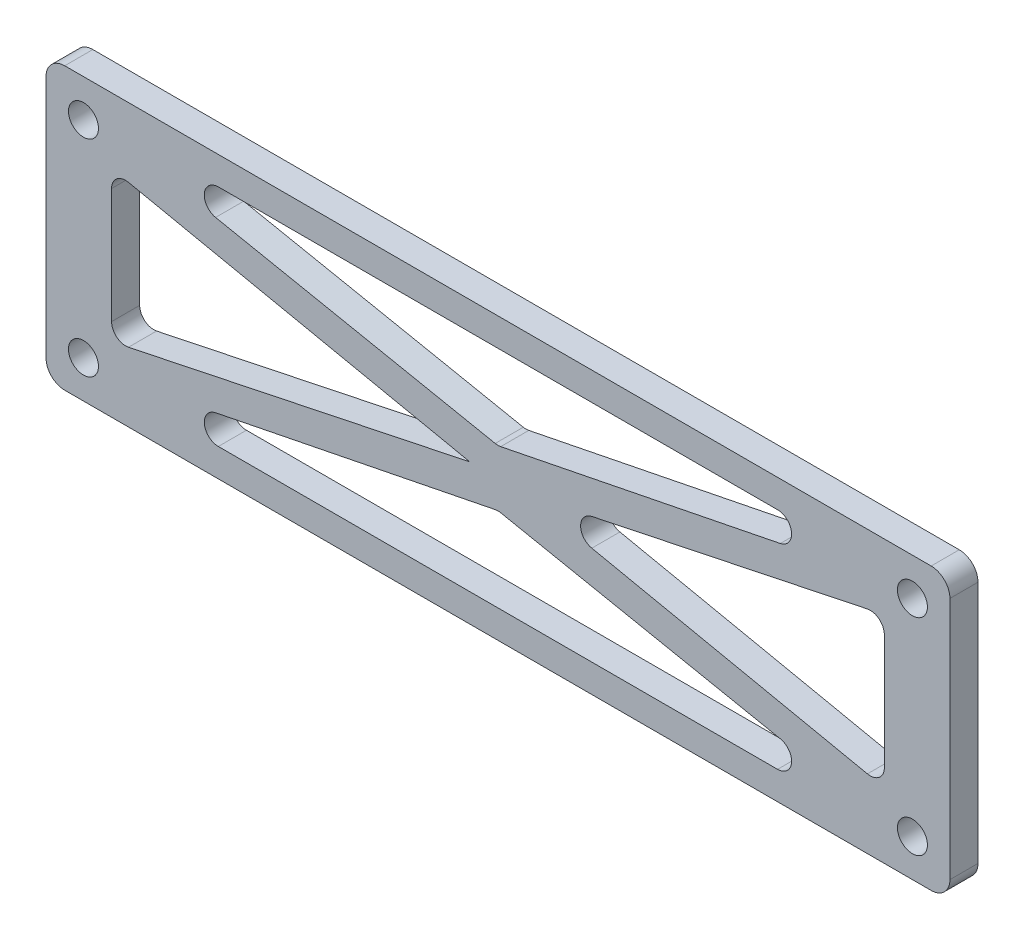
ISO-10303-21;
HEADER;
FILE_DESCRIPTION(('STEP AP214'),'2;1');
FILE_NAME('part.step','',(''),(''),'','','');
FILE_SCHEMA(('AUTOMOTIVE_DESIGN { 1 0 10303 214 1 1 1 1 }'));
ENDSEC;
DATA;
#1=APPLICATION_CONTEXT('core data for automotive mechanical design processes');
#2=APPLICATION_PROTOCOL_DEFINITION('international standard','automotive_design',2000,#1);
#3=PRODUCT_CONTEXT('',#1,'mechanical');
#4=PRODUCT('Part','Part','',(#3));
#5=PRODUCT_RELATED_PRODUCT_CATEGORY('part','',(#4));
#6=PRODUCT_DEFINITION_FORMATION('','',#4);
#7=PRODUCT_DEFINITION_CONTEXT('part definition',#1,'design');
#8=PRODUCT_DEFINITION('design','',#6,#7);
#9=PRODUCT_DEFINITION_SHAPE('','',#8);
#10=(LENGTH_UNIT() NAMED_UNIT(*) SI_UNIT(.MILLI.,.METRE.));
#11=(NAMED_UNIT(*) PLANE_ANGLE_UNIT() SI_UNIT($,.RADIAN.));
#12=(NAMED_UNIT(*) SI_UNIT($,.STERADIAN.) SOLID_ANGLE_UNIT());
#13=UNCERTAINTY_MEASURE_WITH_UNIT(LENGTH_MEASURE(1.E-05),#10,'distance_accuracy_value','');
#14=(GEOMETRIC_REPRESENTATION_CONTEXT(3) GLOBAL_UNCERTAINTY_ASSIGNED_CONTEXT((#13)) GLOBAL_UNIT_ASSIGNED_CONTEXT((#10,
#11,#12)) REPRESENTATION_CONTEXT('',''));
#15=CARTESIAN_POINT('',(0.,0.,0.));
#16=DIRECTION('',(0.,0.,1.));
#17=DIRECTION('',(1.,0.,0.));
#18=AXIS2_PLACEMENT_3D('',#15,#16,#17);
#19=CARTESIAN_POINT('',(0.,0.,3.));
#20=DIRECTION('',(0.,0.,-1.));
#21=DIRECTION('',(-1.,0.,0.));
#22=AXIS2_PLACEMENT_3D('',#19,#20,#21);
#23=PLANE('',#22);
#24=CARTESIAN_POINT('',(-39.7507771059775,6.15382544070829,3.));
#25=DIRECTION('',(0.,0.,1.));
#26=DIRECTION('',(1.,0.,0.));
#27=AXIS2_PLACEMENT_3D('',#24,#25,#26);
#28=CIRCLE('',#27,1.5);
#29=CARTESIAN_POINT('',(-41.2507771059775,6.15382544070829,3.));
#30=VERTEX_POINT('',#29);
#31=CARTESIAN_POINT('',(-39.4437021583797,7.62205736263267,3.));
#32=VERTEX_POINT('',#31);
#33=EDGE_CURVE('E538',#30,#32,#28,.F.);
#34=ORIENTED_EDGE('',*,*,#33,.T.);
#35=DIRECTION('',(-0.978821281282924,0.2047166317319,0.));
#36=VECTOR('',#35,1.);
#37=CARTESIAN_POINT('',(-3.,0.,3.));
#38=LINE('',#37,#36);
#39=CARTESIAN_POINT('',(-2.99999999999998,0.,3.));
#40=VERTEX_POINT('',#39);
#41=EDGE_CURVE('E867',#32,#40,#38,.F.);
#42=ORIENTED_EDGE('',*,*,#41,.T.);
#43=DIRECTION('',(0.978821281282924,0.2047166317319,0.));
#44=VECTOR('',#43,1.);
#45=CARTESIAN_POINT('',(-39.4437021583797,-7.62205736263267,3.));
#46=LINE('',#45,#44);
#47=CARTESIAN_POINT('',(-39.4437021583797,-7.62205736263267,3.));
#48=VERTEX_POINT('',#47);
#49=EDGE_CURVE('E863',#40,#48,#46,.F.);
#50=ORIENTED_EDGE('',*,*,#49,.T.);
#51=CARTESIAN_POINT('',(-39.7507771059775,-6.15382544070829,3.));
#52=DIRECTION('',(0.,0.,1.));
#53=DIRECTION('',(1.,0.,0.));
#54=AXIS2_PLACEMENT_3D('',#51,#52,#53);
#55=CIRCLE('',#54,1.5);
#56=CARTESIAN_POINT('',(-41.2507771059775,-6.15382544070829,3.));
#57=VERTEX_POINT('',#56);
#58=EDGE_CURVE('E858',#57,#48,#55,.T.);
#59=ORIENTED_EDGE('',*,*,#58,.F.);
#60=DIRECTION('',(0.,1.,0.));
#61=VECTOR('',#60,1.);
#62=CARTESIAN_POINT('',(-41.2507771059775,0.,3.));
#63=LINE('',#62,#61);
#64=EDGE_CURVE('E854',#57,#30,#63,.T.);
#65=ORIENTED_EDGE('',*,*,#64,.T.);
#66=EDGE_LOOP('',(#34,#42,#50,#59,#65));
#67=FACE_BOUND('',#66,.T.);
#68=DIRECTION('',(0.98058067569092,0.196116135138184,0.));
#69=VECTOR('',#68,1.);
#70=CARTESIAN_POINT('',(0.294174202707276,3.05883484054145,3.));
#71=LINE('',#70,#69);
#72=CARTESIAN_POINT('',(30.1456449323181,9.02912898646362,3.));
#73=VERTEX_POINT('',#72);
#74=CARTESIAN_POINT('',(0.294174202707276,3.05883484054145,3.));
#75=VERTEX_POINT('',#74);
#76=EDGE_CURVE('E672',#73,#75,#71,.F.);
#77=ORIENTED_EDGE('',*,*,#76,.T.);
#78=CARTESIAN_POINT('',(0.,4.52970585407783,3.));
#79=DIRECTION('',(0.,0.,1.));
#80=DIRECTION('',(1.,0.,0.));
#81=AXIS2_PLACEMENT_3D('',#78,#79,#80);
#82=CIRCLE('',#81,1.5);
#83=CARTESIAN_POINT('',(-0.294174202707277,3.05883484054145,3.));
#84=VERTEX_POINT('',#83);
#85=EDGE_CURVE('E744',#75,#84,#82,.F.);
#86=ORIENTED_EDGE('',*,*,#85,.T.);
#87=DIRECTION('',(0.98058067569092,-0.196116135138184,0.));
#88=VECTOR('',#87,1.);
#89=CARTESIAN_POINT('',(-30.1456449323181,9.02912898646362,3.));
#90=LINE('',#89,#88);
#91=CARTESIAN_POINT('',(-30.1456449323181,9.02912898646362,3.));
#92=VERTEX_POINT('',#91);
#93=EDGE_CURVE('E740',#84,#92,#90,.F.);
#94=ORIENTED_EDGE('',*,*,#93,.T.);
#95=CARTESIAN_POINT('',(-29.8514707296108,10.5,3.));
#96=DIRECTION('',(0.,0.,1.));
#97=DIRECTION('',(1.,0.,0.));
#98=AXIS2_PLACEMENT_3D('',#95,#96,#97);
#99=CIRCLE('',#98,1.5);
#100=CARTESIAN_POINT('',(-29.8514707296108,12.,3.));
#101=VERTEX_POINT('',#100);
#102=EDGE_CURVE('E736',#92,#101,#99,.F.);
#103=ORIENTED_EDGE('',*,*,#102,.T.);
#104=DIRECTION('',(-1.,0.,0.));
#105=VECTOR('',#104,1.);
#106=CARTESIAN_POINT('',(0.,12.,3.));
#107=LINE('',#106,#105);
#108=CARTESIAN_POINT('',(29.8514707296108,12.,3.));
#109=VERTEX_POINT('',#108);
#110=EDGE_CURVE('E732',#101,#109,#107,.F.);
#111=ORIENTED_EDGE('',*,*,#110,.T.);
#112=CARTESIAN_POINT('',(29.8514707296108,10.5,3.));
#113=DIRECTION('',(0.,0.,1.));
#114=DIRECTION('',(1.,0.,0.));
#115=AXIS2_PLACEMENT_3D('',#112,#113,#114);
#116=CIRCLE('',#115,1.5);
#117=EDGE_CURVE('E649',#73,#109,#116,.T.);
#118=ORIENTED_EDGE('',*,*,#117,.F.);
#119=EDGE_LOOP('',(#77,#86,#94,#103,#111,#118));
#120=FACE_BOUND('',#119,.T.);
#121=CARTESIAN_POINT('',(-44.2507771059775,11.,3.));
#122=DIRECTION('',(0.,0.,-1.));
#123=DIRECTION('',(-1.,0.,0.));
#124=AXIS2_PLACEMENT_3D('',#121,#122,#123);
#125=CIRCLE('',#124,1.6);
#126=CARTESIAN_POINT('',(-45.8507771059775,11.,3.));
#127=VERTEX_POINT('',#126);
#128=EDGE_CURVE('E667',#127,#127,#125,.T.);
#129=ORIENTED_EDGE('',*,*,#128,.T.);
#130=EDGE_LOOP('',(#129));
#131=FACE_BOUND('',#130,.T.);
#132=CARTESIAN_POINT('',(-44.2507771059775,-11.,3.));
#133=DIRECTION('',(0.,0.,1.));
#134=DIRECTION('',(-1.,0.,0.));
#135=AXIS2_PLACEMENT_3D('',#132,#133,#134);
#136=CIRCLE('',#135,1.6);
#137=CARTESIAN_POINT('',(-45.8507771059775,-11.,3.));
#138=VERTEX_POINT('',#137);
#139=EDGE_CURVE('E666',#138,#138,#136,.T.);
#140=ORIENTED_EDGE('',*,*,#139,.F.);
#141=EDGE_LOOP('',(#140));
#142=FACE_BOUND('',#141,.T.);
#143=CARTESIAN_POINT('',(44.2507771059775,-11.,3.));
#144=DIRECTION('',(0.,0.,-1.));
#145=DIRECTION('',(1.,0.,0.));
#146=AXIS2_PLACEMENT_3D('',#143,#144,#145);
#147=CIRCLE('',#146,1.6);
#148=CARTESIAN_POINT('',(45.8507771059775,-11.,3.));
#149=VERTEX_POINT('',#148);
#150=EDGE_CURVE('E690',#149,#149,#147,.T.);
#151=ORIENTED_EDGE('',*,*,#150,.T.);
#152=EDGE_LOOP('',(#151));
#153=FACE_BOUND('',#152,.T.);
#154=CARTESIAN_POINT('',(44.2507771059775,11.,3.));
#155=DIRECTION('',(0.,0.,1.));
#156=DIRECTION('',(1.,0.,0.));
#157=AXIS2_PLACEMENT_3D('',#154,#155,#156);
#158=CIRCLE('',#157,1.6);
#159=CARTESIAN_POINT('',(45.8507771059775,11.,3.));
#160=VERTEX_POINT('',#159);
#161=EDGE_CURVE('E689',#160,#160,#158,.T.);
#162=ORIENTED_EDGE('',*,*,#161,.F.);
#163=EDGE_LOOP('',(#162));
#164=FACE_BOUND('',#163,.T.);
#165=DIRECTION('',(1.,0.,0.));
#166=VECTOR('',#165,1.);
#167=CARTESIAN_POINT('',(-48.2507771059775,-15.,3.));
#168=LINE('',#167,#166);
#169=CARTESIAN_POINT('',(-46.2507771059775,-15.,3.));
#170=VERTEX_POINT('',#169);
#171=CARTESIAN_POINT('',(46.2507771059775,-15.,3.));
#172=VERTEX_POINT('',#171);
#173=EDGE_CURVE('E711',#170,#172,#168,.T.);
#174=ORIENTED_EDGE('',*,*,#173,.T.);
#175=CARTESIAN_POINT('',(46.2507771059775,-13.,3.));
#176=DIRECTION('',(0.,0.,-1.));
#177=DIRECTION('',(-1.,0.,0.));
#178=AXIS2_PLACEMENT_3D('',#175,#176,#177);
#179=CIRCLE('',#178,2.);
#180=CARTESIAN_POINT('',(48.2507771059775,-13.,3.));
#181=VERTEX_POINT('',#180);
#182=EDGE_CURVE('E799',#172,#181,#179,.F.);
#183=ORIENTED_EDGE('',*,*,#182,.T.);
#184=DIRECTION('',(0.,1.,0.));
#185=VECTOR('',#184,1.);
#186=CARTESIAN_POINT('',(48.2507771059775,-15.,3.));
#187=LINE('',#186,#185);
#188=CARTESIAN_POINT('',(48.2507771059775,13.,3.));
#189=VERTEX_POINT('',#188);
#190=EDGE_CURVE('E717',#181,#189,#187,.T.);
#191=ORIENTED_EDGE('',*,*,#190,.T.);
#192=CARTESIAN_POINT('',(46.2507771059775,13.,3.));
#193=DIRECTION('',(0.,0.,-1.));
#194=DIRECTION('',(-1.,0.,0.));
#195=AXIS2_PLACEMENT_3D('',#192,#193,#194);
#196=CIRCLE('',#195,2.);
#197=CARTESIAN_POINT('',(46.2507771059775,15.,3.));
#198=VERTEX_POINT('',#197);
#199=EDGE_CURVE('E330',#189,#198,#196,.F.);
#200=ORIENTED_EDGE('',*,*,#199,.T.);
#201=DIRECTION('',(1.,0.,0.));
#202=VECTOR('',#201,1.);
#203=CARTESIAN_POINT('',(-48.2507771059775,15.,3.));
#204=LINE('',#203,#202);
#205=CARTESIAN_POINT('',(-46.2507771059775,15.,3.));
#206=VERTEX_POINT('',#205);
#207=EDGE_CURVE('E818',#206,#198,#204,.T.);
#208=ORIENTED_EDGE('',*,*,#207,.F.);
#209=CARTESIAN_POINT('',(-46.2507771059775,13.,3.));
#210=DIRECTION('',(0.,0.,-1.));
#211=DIRECTION('',(-1.,0.,0.));
#212=AXIS2_PLACEMENT_3D('',#209,#210,#211);
#213=CIRCLE('',#212,2.);
#214=CARTESIAN_POINT('',(-48.2507771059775,13.,3.));
#215=VERTEX_POINT('',#214);
#216=EDGE_CURVE('E794',#206,#215,#213,.F.);
#217=ORIENTED_EDGE('',*,*,#216,.T.);
#218=DIRECTION('',(0.,1.,0.));
#219=VECTOR('',#218,1.);
#220=CARTESIAN_POINT('',(-48.2507771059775,-15.,3.));
#221=LINE('',#220,#219);
#222=CARTESIAN_POINT('',(-48.2507771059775,-13.,3.));
#223=VERTEX_POINT('',#222);
#224=EDGE_CURVE('E703',#223,#215,#221,.T.);
#225=ORIENTED_EDGE('',*,*,#224,.F.);
#226=CARTESIAN_POINT('',(-46.2507771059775,-13.,3.));
#227=DIRECTION('',(0.,0.,-1.));
#228=DIRECTION('',(-1.,0.,0.));
#229=AXIS2_PLACEMENT_3D('',#226,#227,#228);
#230=CIRCLE('',#229,2.);
#231=EDGE_CURVE('E791',#223,#170,#230,.F.);
#232=ORIENTED_EDGE('',*,*,#231,.T.);
#233=EDGE_LOOP('',(#174,#183,#191,#200,#208,#217,#225,#232));
#234=FACE_BOUND('',#233,.T.);
#235=CARTESIAN_POINT('',(39.7507771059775,6.15382544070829,3.));
#236=DIRECTION('',(0.,0.,1.));
#237=DIRECTION('',(1.,0.,0.));
#238=AXIS2_PLACEMENT_3D('',#235,#236,#237);
#239=CIRCLE('',#238,1.5);
#240=CARTESIAN_POINT('',(39.4437021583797,7.62205736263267,3.));
#241=VERTEX_POINT('',#240);
#242=CARTESIAN_POINT('',(41.2507771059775,6.15382544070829,3.));
#243=VERTEX_POINT('',#242);
#244=EDGE_CURVE('E848',#241,#243,#239,.F.);
#245=ORIENTED_EDGE('',*,*,#244,.T.);
#246=DIRECTION('',(0.,1.,0.));
#247=VECTOR('',#246,1.);
#248=CARTESIAN_POINT('',(41.2507771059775,0.,3.));
#249=LINE('',#248,#247);
#250=CARTESIAN_POINT('',(41.2507771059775,-6.15382544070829,3.));
#251=VERTEX_POINT('',#250);
#252=EDGE_CURVE('E844',#251,#243,#249,.T.);
#253=ORIENTED_EDGE('',*,*,#252,.F.);
#254=CARTESIAN_POINT('',(39.7507771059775,-6.15382544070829,3.));
#255=DIRECTION('',(0.,0.,1.));
#256=DIRECTION('',(1.,0.,0.));
#257=AXIS2_PLACEMENT_3D('',#254,#255,#256);
#258=CIRCLE('',#257,1.5);
#259=CARTESIAN_POINT('',(39.4437021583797,-7.62205736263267,3.));
#260=VERTEX_POINT('',#259);
#261=EDGE_CURVE('E849',#260,#251,#258,.T.);
#262=ORIENTED_EDGE('',*,*,#261,.F.);
#263=DIRECTION('',(0.978821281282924,-0.2047166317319,0.));
#264=VECTOR('',#263,1.);
#265=CARTESIAN_POINT('',(0.125726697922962,0.601142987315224,3.));
#266=LINE('',#265,#264);
#267=CARTESIAN_POINT('',(10.0201264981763,-1.46823192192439,3.));
#268=VERTEX_POINT('',#267);
#269=EDGE_CURVE('E1283',#268,#260,#266,.T.);
#270=ORIENTED_EDGE('',*,*,#269,.F.);
#271=CARTESIAN_POINT('',(10.3272014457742,0.,3.));
#272=DIRECTION('',(0.,0.,1.));
#273=DIRECTION('',(1.,0.,0.));
#274=AXIS2_PLACEMENT_3D('',#271,#272,#273);
#275=CIRCLE('',#274,1.5);
#276=CARTESIAN_POINT('',(10.0201264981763,1.46823192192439,3.));
#277=VERTEX_POINT('',#276);
#278=EDGE_CURVE('E754',#277,#268,#275,.T.);
#279=ORIENTED_EDGE('',*,*,#278,.F.);
#280=DIRECTION('',(-0.978821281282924,-0.2047166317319,0.));
#281=VECTOR('',#280,1.);
#282=CARTESIAN_POINT('',(0.125726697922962,-0.601142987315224,3.));
#283=LINE('',#282,#281);
#284=EDGE_CURVE('E620',#241,#277,#283,.T.);
#285=ORIENTED_EDGE('',*,*,#284,.F.);
#286=EDGE_LOOP('',(#245,#253,#262,#270,#279,#285));
#287=FACE_BOUND('',#286,.T.);
#288=CARTESIAN_POINT('',(29.8514707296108,-10.5,3.));
#289=DIRECTION('',(0.,0.,1.));
#290=DIRECTION('',(1.,0.,0.));
#291=AXIS2_PLACEMENT_3D('',#288,#289,#290);
#292=CIRCLE('',#291,1.5);
#293=CARTESIAN_POINT('',(30.1456449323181,-9.02912898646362,3.));
#294=VERTEX_POINT('',#293);
#295=CARTESIAN_POINT('',(29.8514707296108,-12.,3.));
#296=VERTEX_POINT('',#295);
#297=EDGE_CURVE('E633',#294,#296,#292,.F.);
#298=ORIENTED_EDGE('',*,*,#297,.T.);
#299=DIRECTION('',(1.,0.,0.));
#300=VECTOR('',#299,1.);
#301=CARTESIAN_POINT('',(0.,-12.,3.));
#302=LINE('',#301,#300);
#303=CARTESIAN_POINT('',(-29.8514707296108,-12.,3.));
#304=VERTEX_POINT('',#303);
#305=EDGE_CURVE('E764',#304,#296,#302,.T.);
#306=ORIENTED_EDGE('',*,*,#305,.F.);
#307=CARTESIAN_POINT('',(-29.8514707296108,-10.5,3.));
#308=DIRECTION('',(0.,0.,1.));
#309=DIRECTION('',(1.,0.,0.));
#310=AXIS2_PLACEMENT_3D('',#307,#308,#309);
#311=CIRCLE('',#310,1.5);
#312=CARTESIAN_POINT('',(-30.1456449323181,-9.02912898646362,3.));
#313=VERTEX_POINT('',#312);
#314=EDGE_CURVE('E768',#313,#304,#311,.T.);
#315=ORIENTED_EDGE('',*,*,#314,.F.);
#316=DIRECTION('',(-0.98058067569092,-0.196116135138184,0.));
#317=VECTOR('',#316,1.);
#318=CARTESIAN_POINT('',(0.576923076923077,-2.88461538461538,3.));
#319=LINE('',#318,#317);
#320=CARTESIAN_POINT('',(-0.294174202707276,-3.05883484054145,3.));
#321=VERTEX_POINT('',#320);
#322=EDGE_CURVE('E879',#321,#313,#319,.T.);
#323=ORIENTED_EDGE('',*,*,#322,.F.);
#324=CARTESIAN_POINT('',(0.,-4.52970585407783,3.));
#325=DIRECTION('',(0.,0.,1.));
#326=DIRECTION('',(1.,0.,0.));
#327=AXIS2_PLACEMENT_3D('',#324,#325,#326);
#328=CIRCLE('',#327,1.5);
#329=CARTESIAN_POINT('',(0.294174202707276,-3.05883484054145,3.));
#330=VERTEX_POINT('',#329);
#331=EDGE_CURVE('E876',#321,#330,#328,.F.);
#332=ORIENTED_EDGE('',*,*,#331,.T.);
#333=DIRECTION('',(-0.98058067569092,0.196116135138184,0.));
#334=VECTOR('',#333,1.);
#335=CARTESIAN_POINT('',(-0.576923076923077,-2.88461538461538,3.));
#336=LINE('',#335,#334);
#337=EDGE_CURVE('E872',#294,#330,#336,.T.);
#338=ORIENTED_EDGE('',*,*,#337,.F.);
#339=EDGE_LOOP('',(#298,#306,#315,#323,#332,#338));
#340=FACE_BOUND('',#339,.T.);
#341=ADVANCED_FACE('F315',(#67,#120,#131,#142,#153,#164,#234,#287,#340),#23,.F.);
#342=CARTESIAN_POINT('',(0.,0.,0.));
#343=DIRECTION('',(0.,0.,-1.));
#344=DIRECTION('',(-1.,0.,0.));
#345=AXIS2_PLACEMENT_3D('',#342,#343,#344);
#346=PLANE('',#345);
#347=CARTESIAN_POINT('',(-44.2507771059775,11.,0.));
#348=DIRECTION('',(0.,0.,-1.));
#349=DIRECTION('',(-1.,0.,0.));
#350=AXIS2_PLACEMENT_3D('',#347,#348,#349);
#351=CIRCLE('',#350,1.6);
#352=CARTESIAN_POINT('',(-45.8507771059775,11.,0.));
#353=VERTEX_POINT('',#352);
#354=EDGE_CURVE('E663',#353,#353,#351,.T.);
#355=ORIENTED_EDGE('',*,*,#354,.F.);
#356=EDGE_LOOP('',(#355));
#357=FACE_BOUND('',#356,.T.);
#358=CARTESIAN_POINT('',(-44.2507771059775,-11.,0.));
#359=DIRECTION('',(0.,0.,1.));
#360=DIRECTION('',(-1.,0.,0.));
#361=AXIS2_PLACEMENT_3D('',#358,#359,#360);
#362=CIRCLE('',#361,1.6);
#363=CARTESIAN_POINT('',(-45.8507771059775,-11.,0.));
#364=VERTEX_POINT('',#363);
#365=EDGE_CURVE('E673',#364,#364,#362,.T.);
#366=ORIENTED_EDGE('',*,*,#365,.T.);
#367=EDGE_LOOP('',(#366));
#368=FACE_BOUND('',#367,.T.);
#369=CARTESIAN_POINT('',(44.2507771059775,-11.,0.));
#370=DIRECTION('',(0.,0.,-1.));
#371=DIRECTION('',(1.,0.,0.));
#372=AXIS2_PLACEMENT_3D('',#369,#370,#371);
#373=CIRCLE('',#372,1.6);
#374=CARTESIAN_POINT('',(45.8507771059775,-11.,0.));
#375=VERTEX_POINT('',#374);
#376=EDGE_CURVE('E687',#375,#375,#373,.T.);
#377=ORIENTED_EDGE('',*,*,#376,.F.);
#378=EDGE_LOOP('',(#377));
#379=FACE_BOUND('',#378,.T.);
#380=CARTESIAN_POINT('',(44.2507771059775,11.,0.));
#381=DIRECTION('',(0.,0.,1.));
#382=DIRECTION('',(1.,0.,0.));
#383=AXIS2_PLACEMENT_3D('',#380,#381,#382);
#384=CIRCLE('',#383,1.6);
#385=CARTESIAN_POINT('',(45.8507771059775,11.,0.));
#386=VERTEX_POINT('',#385);
#387=EDGE_CURVE('E695',#386,#386,#384,.T.);
#388=ORIENTED_EDGE('',*,*,#387,.T.);
#389=EDGE_LOOP('',(#388));
#390=FACE_BOUND('',#389,.T.);
#391=DIRECTION('',(0.,1.,0.));
#392=VECTOR('',#391,1.);
#393=CARTESIAN_POINT('',(48.2507771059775,-15.,0.));
#394=LINE('',#393,#392);
#395=CARTESIAN_POINT('',(48.2507771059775,-13.,0.));
#396=VERTEX_POINT('',#395);
#397=CARTESIAN_POINT('',(48.2507771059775,13.,0.));
#398=VERTEX_POINT('',#397);
#399=EDGE_CURVE('E724',#396,#398,#394,.T.);
#400=ORIENTED_EDGE('',*,*,#399,.F.);
#401=CARTESIAN_POINT('',(46.2507771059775,-13.,0.));
#402=DIRECTION('',(0.,0.,-1.));
#403=DIRECTION('',(-1.,0.,0.));
#404=AXIS2_PLACEMENT_3D('',#401,#402,#403);
#405=CIRCLE('',#404,2.);
#406=CARTESIAN_POINT('',(46.2507771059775,-15.,0.));
#407=VERTEX_POINT('',#406);
#408=EDGE_CURVE('E784',#396,#407,#405,.T.);
#409=ORIENTED_EDGE('',*,*,#408,.T.);
#410=DIRECTION('',(1.,0.,0.));
#411=VECTOR('',#410,1.);
#412=CARTESIAN_POINT('',(-48.2507771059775,-15.,0.));
#413=LINE('',#412,#411);
#414=CARTESIAN_POINT('',(-46.2507771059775,-15.,0.));
#415=VERTEX_POINT('',#414);
#416=EDGE_CURVE('E727',#415,#407,#413,.T.);
#417=ORIENTED_EDGE('',*,*,#416,.F.);
#418=CARTESIAN_POINT('',(-46.2507771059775,-13.,0.));
#419=DIRECTION('',(0.,0.,-1.));
#420=DIRECTION('',(-1.,0.,0.));
#421=AXIS2_PLACEMENT_3D('',#418,#419,#420);
#422=CIRCLE('',#421,2.);
#423=CARTESIAN_POINT('',(-48.2507771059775,-13.,0.));
#424=VERTEX_POINT('',#423);
#425=EDGE_CURVE('E778',#415,#424,#422,.T.);
#426=ORIENTED_EDGE('',*,*,#425,.T.);
#427=DIRECTION('',(0.,1.,0.));
#428=VECTOR('',#427,1.);
#429=CARTESIAN_POINT('',(-48.2507771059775,-15.,0.));
#430=LINE('',#429,#428);
#431=CARTESIAN_POINT('',(-48.2507771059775,13.,0.));
#432=VERTEX_POINT('',#431);
#433=EDGE_CURVE('E698',#424,#432,#430,.T.);
#434=ORIENTED_EDGE('',*,*,#433,.T.);
#435=CARTESIAN_POINT('',(-46.2507771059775,13.,0.));
#436=DIRECTION('',(0.,0.,-1.));
#437=DIRECTION('',(-1.,0.,0.));
#438=AXIS2_PLACEMENT_3D('',#435,#436,#437);
#439=CIRCLE('',#438,2.);
#440=CARTESIAN_POINT('',(-46.2507771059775,15.,0.));
#441=VERTEX_POINT('',#440);
#442=EDGE_CURVE('E780',#432,#441,#439,.T.);
#443=ORIENTED_EDGE('',*,*,#442,.T.);
#444=DIRECTION('',(1.,0.,0.));
#445=VECTOR('',#444,1.);
#446=CARTESIAN_POINT('',(-48.2507771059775,15.,0.));
#447=LINE('',#446,#445);
#448=CARTESIAN_POINT('',(46.2507771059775,15.,0.));
#449=VERTEX_POINT('',#448);
#450=EDGE_CURVE('E721',#441,#449,#447,.T.);
#451=ORIENTED_EDGE('',*,*,#450,.T.);
#452=CARTESIAN_POINT('',(46.2507771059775,13.,0.));
#453=DIRECTION('',(0.,0.,-1.));
#454=DIRECTION('',(-1.,0.,0.));
#455=AXIS2_PLACEMENT_3D('',#452,#453,#454);
#456=CIRCLE('',#455,2.);
#457=EDGE_CURVE('E782',#449,#398,#456,.T.);
#458=ORIENTED_EDGE('',*,*,#457,.T.);
#459=EDGE_LOOP('',(#400,#409,#417,#426,#434,#443,#451,#458));
#460=FACE_BOUND('',#459,.T.);
#461=CARTESIAN_POINT('',(0.,4.52970585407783,0.));
#462=DIRECTION('',(0.,0.,1.));
#463=DIRECTION('',(1.,0.,0.));
#464=AXIS2_PLACEMENT_3D('',#461,#462,#463);
#465=CIRCLE('',#464,1.5);
#466=CARTESIAN_POINT('',(0.294174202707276,3.05883484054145,0.));
#467=VERTEX_POINT('',#466);
#468=CARTESIAN_POINT('',(-0.294174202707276,3.05883484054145,0.));
#469=VERTEX_POINT('',#468);
#470=EDGE_CURVE('E643',#467,#469,#465,.F.);
#471=ORIENTED_EDGE('',*,*,#470,.F.);
#472=DIRECTION('',(-0.98058067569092,-0.196116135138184,0.));
#473=VECTOR('',#472,1.);
#474=CARTESIAN_POINT('',(-0.576923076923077,2.88461538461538,0.));
#475=LINE('',#474,#473);
#476=CARTESIAN_POINT('',(30.1456449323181,9.02912898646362,0.));
#477=VERTEX_POINT('',#476);
#478=EDGE_CURVE('E630',#477,#467,#475,.T.);
#479=ORIENTED_EDGE('',*,*,#478,.F.);
#480=CARTESIAN_POINT('',(29.8514707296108,10.5,0.));
#481=DIRECTION('',(0.,0.,1.));
#482=DIRECTION('',(1.,0.,0.));
#483=AXIS2_PLACEMENT_3D('',#480,#481,#482);
#484=CIRCLE('',#483,1.5);
#485=CARTESIAN_POINT('',(29.8514707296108,12.,0.));
#486=VERTEX_POINT('',#485);
#487=EDGE_CURVE('E632',#477,#486,#484,.T.);
#488=ORIENTED_EDGE('',*,*,#487,.T.);
#489=DIRECTION('',(1.,0.,0.));
#490=VECTOR('',#489,1.);
#491=CARTESIAN_POINT('',(0.,12.,0.));
#492=LINE('',#491,#490);
#493=CARTESIAN_POINT('',(-29.8514707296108,12.,0.));
#494=VERTEX_POINT('',#493);
#495=EDGE_CURVE('E636',#494,#486,#492,.T.);
#496=ORIENTED_EDGE('',*,*,#495,.F.);
#497=CARTESIAN_POINT('',(-29.8514707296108,10.5,0.));
#498=DIRECTION('',(0.,0.,1.));
#499=DIRECTION('',(1.,0.,0.));
#500=AXIS2_PLACEMENT_3D('',#497,#498,#499);
#501=CIRCLE('',#500,1.5);
#502=CARTESIAN_POINT('',(-30.1456449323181,9.02912898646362,0.));
#503=VERTEX_POINT('',#502);
#504=EDGE_CURVE('E639',#503,#494,#501,.F.);
#505=ORIENTED_EDGE('',*,*,#504,.F.);
#506=DIRECTION('',(-0.98058067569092,0.196116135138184,0.));
#507=VECTOR('',#506,1.);
#508=CARTESIAN_POINT('',(0.576923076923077,2.88461538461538,0.));
#509=LINE('',#508,#507);
#510=EDGE_CURVE('E641',#469,#503,#509,.T.);
#511=ORIENTED_EDGE('',*,*,#510,.F.);
#512=EDGE_LOOP('',(#471,#479,#488,#496,#505,#511));
#513=FACE_BOUND('',#512,.T.);
#514=DIRECTION('',(0.,1.,0.));
#515=VECTOR('',#514,1.);
#516=CARTESIAN_POINT('',(41.2507771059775,0.,0.));
#517=LINE('',#516,#515);
#518=CARTESIAN_POINT('',(41.2507771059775,-6.15382544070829,0.));
#519=VERTEX_POINT('',#518);
#520=CARTESIAN_POINT('',(41.2507771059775,6.15382544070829,0.));
#521=VERTEX_POINT('',#520);
#522=EDGE_CURVE('E609',#519,#521,#517,.T.);
#523=ORIENTED_EDGE('',*,*,#522,.T.);
#524=CARTESIAN_POINT('',(39.7507771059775,6.15382544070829,0.));
#525=DIRECTION('',(0.,0.,1.));
#526=DIRECTION('',(1.,0.,0.));
#527=AXIS2_PLACEMENT_3D('',#524,#525,#526);
#528=CIRCLE('',#527,1.5);
#529=CARTESIAN_POINT('',(39.4437021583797,7.62205736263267,0.));
#530=VERTEX_POINT('',#529);
#531=EDGE_CURVE('E586',#530,#521,#528,.F.);
#532=ORIENTED_EDGE('',*,*,#531,.F.);
#533=DIRECTION('',(-0.978821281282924,-0.2047166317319,0.));
#534=VECTOR('',#533,1.);
#535=CARTESIAN_POINT('',(0.125726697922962,-0.601142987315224,0.));
#536=LINE('',#535,#534);
#537=CARTESIAN_POINT('',(10.0201264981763,1.46823192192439,0.));
#538=VERTEX_POINT('',#537);
#539=EDGE_CURVE('E597',#530,#538,#536,.T.);
#540=ORIENTED_EDGE('',*,*,#539,.T.);
#541=CARTESIAN_POINT('',(10.3272014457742,0.,0.));
#542=DIRECTION('',(0.,0.,1.));
#543=DIRECTION('',(1.,0.,0.));
#544=AXIS2_PLACEMENT_3D('',#541,#542,#543);
#545=CIRCLE('',#544,1.5);
#546=CARTESIAN_POINT('',(10.0201264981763,-1.46823192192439,0.));
#547=VERTEX_POINT('',#546);
#548=EDGE_CURVE('E600',#538,#547,#545,.T.);
#549=ORIENTED_EDGE('',*,*,#548,.T.);
#550=DIRECTION('',(0.978821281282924,-0.2047166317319,0.));
#551=VECTOR('',#550,1.);
#552=CARTESIAN_POINT('',(0.125726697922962,0.601142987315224,0.));
#553=LINE('',#552,#551);
#554=CARTESIAN_POINT('',(39.4437021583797,-7.62205736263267,0.));
#555=VERTEX_POINT('',#554);
#556=EDGE_CURVE('E603',#547,#555,#553,.T.);
#557=ORIENTED_EDGE('',*,*,#556,.T.);
#558=CARTESIAN_POINT('',(39.7507771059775,-6.15382544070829,0.));
#559=DIRECTION('',(0.,0.,1.));
#560=DIRECTION('',(1.,0.,0.));
#561=AXIS2_PLACEMENT_3D('',#558,#559,#560);
#562=CIRCLE('',#561,1.5);
#563=EDGE_CURVE('E606',#555,#519,#562,.T.);
#564=ORIENTED_EDGE('',*,*,#563,.T.);
#565=EDGE_LOOP('',(#523,#532,#540,#549,#557,#564));
#566=FACE_BOUND('',#565,.T.);
#567=DIRECTION('',(0.978821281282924,-0.2047166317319,0.));
#568=VECTOR('',#567,1.);
#569=CARTESIAN_POINT('',(-0.125726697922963,-0.601142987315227,0.));
#570=LINE('',#569,#568);
#571=CARTESIAN_POINT('',(-39.4437021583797,7.62205736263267,0.));
#572=VERTEX_POINT('',#571);
#573=CARTESIAN_POINT('',(-3.,0.,0.));
#574=VERTEX_POINT('',#573);
#575=EDGE_CURVE('E540',#572,#574,#570,.T.);
#576=ORIENTED_EDGE('',*,*,#575,.F.);
#577=CARTESIAN_POINT('',(-39.7507771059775,6.15382544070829,0.));
#578=DIRECTION('',(0.,0.,1.));
#579=DIRECTION('',(1.,0.,0.));
#580=AXIS2_PLACEMENT_3D('',#577,#578,#579);
#581=CIRCLE('',#580,1.5);
#582=CARTESIAN_POINT('',(-41.2507771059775,6.15382544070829,0.));
#583=VERTEX_POINT('',#582);
#584=EDGE_CURVE('E531',#583,#572,#581,.F.);
#585=ORIENTED_EDGE('',*,*,#584,.F.);
#586=DIRECTION('',(0.,1.,0.));
#587=VECTOR('',#586,1.);
#588=CARTESIAN_POINT('',(-41.2507771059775,0.,0.));
#589=LINE('',#588,#587);
#590=CARTESIAN_POINT('',(-41.2507771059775,-6.15382544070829,0.));
#591=VERTEX_POINT('',#590);
#592=EDGE_CURVE('E520',#591,#583,#589,.T.);
#593=ORIENTED_EDGE('',*,*,#592,.F.);
#594=CARTESIAN_POINT('',(-39.7507771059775,-6.15382544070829,0.));
#595=DIRECTION('',(0.,0.,1.));
#596=DIRECTION('',(1.,0.,0.));
#597=AXIS2_PLACEMENT_3D('',#594,#595,#596);
#598=CIRCLE('',#597,1.5);
#599=CARTESIAN_POINT('',(-39.4437021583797,-7.62205736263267,0.));
#600=VERTEX_POINT('',#599);
#601=EDGE_CURVE('E530',#591,#600,#598,.T.);
#602=ORIENTED_EDGE('',*,*,#601,.T.);
#603=DIRECTION('',(-0.978821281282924,-0.2047166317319,0.));
#604=VECTOR('',#603,1.);
#605=CARTESIAN_POINT('',(-0.125726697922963,0.601142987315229,0.));
#606=LINE('',#605,#604);
#607=EDGE_CURVE('E549',#574,#600,#606,.T.);
#608=ORIENTED_EDGE('',*,*,#607,.F.);
#609=EDGE_LOOP('',(#576,#585,#593,#602,#608));
#610=FACE_BOUND('',#609,.T.);
#611=DIRECTION('',(1.,0.,0.));
#612=VECTOR('',#611,1.);
#613=CARTESIAN_POINT('',(0.,-12.,0.));
#614=LINE('',#613,#612);
#615=CARTESIAN_POINT('',(-29.8514707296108,-12.,0.));
#616=VERTEX_POINT('',#615);
#617=CARTESIAN_POINT('',(29.8514707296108,-12.,0.));
#618=VERTEX_POINT('',#617);
#619=EDGE_CURVE('E575',#616,#618,#614,.T.);
#620=ORIENTED_EDGE('',*,*,#619,.T.);
#621=CARTESIAN_POINT('',(29.8514707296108,-10.5,0.));
#622=DIRECTION('',(0.,0.,1.));
#623=DIRECTION('',(1.,0.,0.));
#624=AXIS2_PLACEMENT_3D('',#621,#622,#623);
#625=CIRCLE('',#624,1.5);
#626=CARTESIAN_POINT('',(30.1456449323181,-9.02912898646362,0.));
#627=VERTEX_POINT('',#626);
#628=EDGE_CURVE('E554',#627,#618,#625,.F.);
#629=ORIENTED_EDGE('',*,*,#628,.F.);
#630=DIRECTION('',(-0.98058067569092,0.196116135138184,0.));
#631=VECTOR('',#630,1.);
#632=CARTESIAN_POINT('',(-0.576923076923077,-2.88461538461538,0.));
#633=LINE('',#632,#631);
#634=CARTESIAN_POINT('',(0.294174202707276,-3.05883484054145,0.));
#635=VERTEX_POINT('',#634);
#636=EDGE_CURVE('E563',#627,#635,#633,.T.);
#637=ORIENTED_EDGE('',*,*,#636,.T.);
#638=CARTESIAN_POINT('',(0.,-4.52970585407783,0.));
#639=DIRECTION('',(0.,0.,1.));
#640=DIRECTION('',(1.,0.,0.));
#641=AXIS2_PLACEMENT_3D('',#638,#639,#640);
#642=CIRCLE('',#641,1.5);
#643=CARTESIAN_POINT('',(-0.294174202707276,-3.05883484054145,0.));
#644=VERTEX_POINT('',#643);
#645=EDGE_CURVE('E566',#644,#635,#642,.F.);
#646=ORIENTED_EDGE('',*,*,#645,.F.);
#647=DIRECTION('',(-0.98058067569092,-0.196116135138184,0.));
#648=VECTOR('',#647,1.);
#649=CARTESIAN_POINT('',(0.576923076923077,-2.88461538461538,0.));
#650=LINE('',#649,#648);
#651=CARTESIAN_POINT('',(-30.1456449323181,-9.02912898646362,0.));
#652=VERTEX_POINT('',#651);
#653=EDGE_CURVE('E569',#644,#652,#650,.T.);
#654=ORIENTED_EDGE('',*,*,#653,.T.);
#655=CARTESIAN_POINT('',(-29.8514707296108,-10.5,0.));
#656=DIRECTION('',(0.,0.,1.));
#657=DIRECTION('',(1.,0.,0.));
#658=AXIS2_PLACEMENT_3D('',#655,#656,#657);
#659=CIRCLE('',#658,1.5);
#660=EDGE_CURVE('E572',#652,#616,#659,.T.);
#661=ORIENTED_EDGE('',*,*,#660,.T.);
#662=EDGE_LOOP('',(#620,#629,#637,#646,#654,#661));
#663=FACE_BOUND('',#662,.T.);
#664=ADVANCED_FACE('F543',(#357,#368,#379,#390,#460,#513,#566,#610,#663),#346,.T.);
#665=CARTESIAN_POINT('',(-48.2507771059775,-15.,3.));
#666=DIRECTION('',(-1.,0.,0.));
#667=DIRECTION('',(0.,0.,1.));
#668=AXIS2_PLACEMENT_3D('',#665,#666,#667);
#669=PLANE('',#668);
#670=ORIENTED_EDGE('',*,*,#224,.T.);
#671=DIRECTION('',(0.,0.,-1.));
#672=VECTOR('',#671,1.);
#673=CARTESIAN_POINT('',(-48.2507771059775,13.,3.));
#674=LINE('',#673,#672);
#675=EDGE_CURVE('E13',#215,#432,#674,.T.);
#676=ORIENTED_EDGE('',*,*,#675,.T.);
#677=ORIENTED_EDGE('',*,*,#433,.F.);
#678=DIRECTION('',(0.,0.,-1.));
#679=VECTOR('',#678,1.);
#680=CARTESIAN_POINT('',(-48.2507771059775,-13.,3.));
#681=LINE('',#680,#679);
#682=EDGE_CURVE('E323',#424,#223,#681,.F.);
#683=ORIENTED_EDGE('',*,*,#682,.T.);
#684=EDGE_LOOP('',(#670,#676,#677,#683));
#685=FACE_BOUND('',#684,.T.);
#686=ADVANCED_FACE('F810',(#685),#669,.T.);
#687=CARTESIAN_POINT('',(-48.2507771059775,-15.,3.));
#688=DIRECTION('',(0.,1.,0.));
#689=DIRECTION('',(0.,0.,1.));
#690=AXIS2_PLACEMENT_3D('',#687,#688,#689);
#691=PLANE('',#690);
#692=ORIENTED_EDGE('',*,*,#416,.T.);
#693=DIRECTION('',(0.,0.,-1.));
#694=VECTOR('',#693,1.);
#695=CARTESIAN_POINT('',(46.2507771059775,-15.,3.));
#696=LINE('',#695,#694);
#697=EDGE_CURVE('E789',#407,#172,#696,.F.);
#698=ORIENTED_EDGE('',*,*,#697,.T.);
#699=ORIENTED_EDGE('',*,*,#173,.F.);
#700=DIRECTION('',(0.,0.,-1.));
#701=VECTOR('',#700,1.);
#702=CARTESIAN_POINT('',(-46.2507771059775,-15.,0.));
#703=LINE('',#702,#701);
#704=EDGE_CURVE('E786',#170,#415,#703,.T.);
#705=ORIENTED_EDGE('',*,*,#704,.T.);
#706=EDGE_LOOP('',(#692,#698,#699,#705));
#707=FACE_BOUND('',#706,.T.);
#708=ADVANCED_FACE('F822',(#707),#691,.F.);
#709=CARTESIAN_POINT('',(48.2507771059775,-15.,3.));
#710=DIRECTION('',(-1.,0.,0.));
#711=DIRECTION('',(0.,0.,1.));
#712=AXIS2_PLACEMENT_3D('',#709,#710,#711);
#713=PLANE('',#712);
#714=ORIENTED_EDGE('',*,*,#190,.F.);
#715=DIRECTION('',(0.,0.,-1.));
#716=VECTOR('',#715,1.);
#717=CARTESIAN_POINT('',(48.2507771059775,-13.,3.));
#718=LINE('',#717,#716);
#719=EDGE_CURVE('E775',#181,#396,#718,.T.);
#720=ORIENTED_EDGE('',*,*,#719,.T.);
#721=ORIENTED_EDGE('',*,*,#399,.T.);
#722=DIRECTION('',(0.,0.,-1.));
#723=VECTOR('',#722,1.);
#724=CARTESIAN_POINT('',(48.2507771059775,13.,3.));
#725=LINE('',#724,#723);
#726=EDGE_CURVE('E716',#398,#189,#725,.F.);
#727=ORIENTED_EDGE('',*,*,#726,.T.);
#728=EDGE_LOOP('',(#714,#720,#721,#727));
#729=FACE_BOUND('',#728,.T.);
#730=ADVANCED_FACE('F833',(#729),#713,.F.);
#731=CARTESIAN_POINT('',(-48.2507771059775,15.,3.));
#732=DIRECTION('',(0.,1.,0.));
#733=DIRECTION('',(0.,0.,1.));
#734=AXIS2_PLACEMENT_3D('',#731,#732,#733);
#735=PLANE('',#734);
#736=ORIENTED_EDGE('',*,*,#207,.T.);
#737=DIRECTION('',(0.,0.,-1.));
#738=VECTOR('',#737,1.);
#739=CARTESIAN_POINT('',(46.2507771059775,15.,0.));
#740=LINE('',#739,#738);
#741=EDGE_CURVE('E803',#198,#449,#740,.T.);
#742=ORIENTED_EDGE('',*,*,#741,.T.);
#743=ORIENTED_EDGE('',*,*,#450,.F.);
#744=DIRECTION('',(0.,0.,-1.));
#745=VECTOR('',#744,1.);
#746=CARTESIAN_POINT('',(-46.2507771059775,15.,3.));
#747=LINE('',#746,#745);
#748=EDGE_CURVE('E337',#441,#206,#747,.F.);
#749=ORIENTED_EDGE('',*,*,#748,.T.);
#750=EDGE_LOOP('',(#736,#742,#743,#749));
#751=FACE_BOUND('',#750,.T.);
#752=ADVANCED_FACE('F935',(#751),#735,.T.);
#753=CARTESIAN_POINT('',(44.2507771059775,11.,0.));
#754=DIRECTION('',(0.,0.,1.));
#755=DIRECTION('',(1.,0.,0.));
#756=AXIS2_PLACEMENT_3D('',#753,#754,#755);
#757=CYLINDRICAL_SURFACE('',#756,1.6);
#758=ORIENTED_EDGE('',*,*,#387,.F.);
#759=EDGE_LOOP('',(#758));
#760=FACE_BOUND('',#759,.T.);
#761=ORIENTED_EDGE('',*,*,#161,.T.);
#762=EDGE_LOOP('',(#761));
#763=FACE_BOUND('',#762,.T.);
#764=ADVANCED_FACE('F928',(#760,#763),#757,.F.);
#765=CARTESIAN_POINT('',(44.2507771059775,-11.,0.));
#766=DIRECTION('',(0.,0.,1.));
#767=DIRECTION('',(1.,0.,0.));
#768=AXIS2_PLACEMENT_3D('',#765,#766,#767);
#769=CYLINDRICAL_SURFACE('',#768,1.6);
#770=ORIENTED_EDGE('',*,*,#376,.T.);
#771=EDGE_LOOP('',(#770));
#772=FACE_BOUND('',#771,.T.);
#773=ORIENTED_EDGE('',*,*,#150,.F.);
#774=EDGE_LOOP('',(#773));
#775=FACE_BOUND('',#774,.T.);
#776=ADVANCED_FACE('F1217',(#772,#775),#769,.F.);
#777=CARTESIAN_POINT('',(-44.2507771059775,-11.,0.));
#778=DIRECTION('',(0.,0.,1.));
#779=DIRECTION('',(1.,0.,0.));
#780=AXIS2_PLACEMENT_3D('',#777,#778,#779);
#781=CYLINDRICAL_SURFACE('',#780,1.6);
#782=ORIENTED_EDGE('',*,*,#365,.F.);
#783=EDGE_LOOP('',(#782));
#784=FACE_BOUND('',#783,.T.);
#785=ORIENTED_EDGE('',*,*,#139,.T.);
#786=EDGE_LOOP('',(#785));
#787=FACE_BOUND('',#786,.T.);
#788=ADVANCED_FACE('F1210',(#784,#787),#781,.F.);
#789=CARTESIAN_POINT('',(-44.2507771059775,11.,0.));
#790=DIRECTION('',(0.,0.,1.));
#791=DIRECTION('',(1.,0.,0.));
#792=AXIS2_PLACEMENT_3D('',#789,#790,#791);
#793=CYLINDRICAL_SURFACE('',#792,1.6);
#794=ORIENTED_EDGE('',*,*,#354,.T.);
#795=EDGE_LOOP('',(#794));
#796=FACE_BOUND('',#795,.T.);
#797=ORIENTED_EDGE('',*,*,#128,.F.);
#798=EDGE_LOOP('',(#797));
#799=FACE_BOUND('',#798,.T.);
#800=ADVANCED_FACE('F1007',(#796,#799),#793,.F.);
#801=CARTESIAN_POINT('',(-0.576923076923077,2.88461538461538,0.));
#802=DIRECTION('',(-0.196116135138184,0.98058067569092,0.));
#803=DIRECTION('',(-0.98058067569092,-0.196116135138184,0.));
#804=AXIS2_PLACEMENT_3D('',#801,#802,#803);
#805=PLANE('',#804);
#806=ORIENTED_EDGE('',*,*,#76,.F.);
#807=DIRECTION('',(0.,0.,1.));
#808=VECTOR('',#807,1.);
#809=CARTESIAN_POINT('',(30.1456449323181,9.02912898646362,0.));
#810=LINE('',#809,#808);
#811=EDGE_CURVE('E645',#477,#73,#810,.T.);
#812=ORIENTED_EDGE('',*,*,#811,.F.);
#813=ORIENTED_EDGE('',*,*,#478,.T.);
#814=DIRECTION('',(0.,0.,1.));
#815=VECTOR('',#814,1.);
#816=CARTESIAN_POINT('',(0.294174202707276,3.05883484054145,0.));
#817=LINE('',#816,#815);
#818=EDGE_CURVE('E646',#467,#75,#817,.T.);
#819=ORIENTED_EDGE('',*,*,#818,.T.);
#820=EDGE_LOOP('',(#806,#812,#813,#819));
#821=FACE_BOUND('',#820,.T.);
#822=ADVANCED_FACE('F1000',(#821),#805,.T.);
#823=CARTESIAN_POINT('',(0.,4.52970585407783,0.));
#824=DIRECTION('',(0.,0.,1.));
#825=DIRECTION('',(1.,0.,0.));
#826=AXIS2_PLACEMENT_3D('',#823,#824,#825);
#827=CYLINDRICAL_SURFACE('',#826,1.5);
#828=ORIENTED_EDGE('',*,*,#85,.F.);
#829=ORIENTED_EDGE('',*,*,#818,.F.);
#830=ORIENTED_EDGE('',*,*,#470,.T.);
#831=DIRECTION('',(0.,0.,1.));
#832=VECTOR('',#831,1.);
#833=CARTESIAN_POINT('',(-0.294174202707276,3.05883484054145,0.));
#834=LINE('',#833,#832);
#835=EDGE_CURVE('E650',#469,#84,#834,.T.);
#836=ORIENTED_EDGE('',*,*,#835,.T.);
#837=EDGE_LOOP('',(#828,#829,#830,#836));
#838=FACE_BOUND('',#837,.T.);
#839=ADVANCED_FACE('F1006',(#838),#827,.F.);
#840=CARTESIAN_POINT('',(0.576923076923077,2.88461538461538,0.));
#841=DIRECTION('',(0.196116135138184,0.98058067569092,0.));
#842=DIRECTION('',(-0.98058067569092,0.196116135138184,0.));
#843=AXIS2_PLACEMENT_3D('',#840,#841,#842);
#844=PLANE('',#843);
#845=ORIENTED_EDGE('',*,*,#93,.F.);
#846=ORIENTED_EDGE('',*,*,#835,.F.);
#847=ORIENTED_EDGE('',*,*,#510,.T.);
#848=DIRECTION('',(0.,0.,1.));
#849=VECTOR('',#848,1.);
#850=CARTESIAN_POINT('',(-30.1456449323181,9.02912898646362,0.));
#851=LINE('',#850,#849);
#852=EDGE_CURVE('E653',#503,#92,#851,.T.);
#853=ORIENTED_EDGE('',*,*,#852,.T.);
#854=EDGE_LOOP('',(#845,#846,#847,#853));
#855=FACE_BOUND('',#854,.T.);
#856=ADVANCED_FACE('F1017',(#855),#844,.T.);
#857=CARTESIAN_POINT('',(-29.8514707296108,10.5,0.));
#858=DIRECTION('',(0.,0.,1.));
#859=DIRECTION('',(1.,0.,0.));
#860=AXIS2_PLACEMENT_3D('',#857,#858,#859);
#861=CYLINDRICAL_SURFACE('',#860,1.5);
#862=ORIENTED_EDGE('',*,*,#102,.F.);
#863=ORIENTED_EDGE('',*,*,#852,.F.);
#864=ORIENTED_EDGE('',*,*,#504,.T.);
#865=DIRECTION('',(0.,0.,1.));
#866=VECTOR('',#865,1.);
#867=CARTESIAN_POINT('',(-29.8514707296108,12.,0.));
#868=LINE('',#867,#866);
#869=EDGE_CURVE('E656',#494,#101,#868,.T.);
#870=ORIENTED_EDGE('',*,*,#869,.T.);
#871=EDGE_LOOP('',(#862,#863,#864,#870));
#872=FACE_BOUND('',#871,.T.);
#873=ADVANCED_FACE('F1026',(#872),#861,.F.);
#874=CARTESIAN_POINT('',(0.,12.,0.));
#875=DIRECTION('',(0.,-1.,0.));
#876=DIRECTION('',(0.,0.,-1.));
#877=AXIS2_PLACEMENT_3D('',#874,#875,#876);
#878=PLANE('',#877);
#879=ORIENTED_EDGE('',*,*,#110,.F.);
#880=ORIENTED_EDGE('',*,*,#869,.F.);
#881=ORIENTED_EDGE('',*,*,#495,.T.);
#882=DIRECTION('',(0.,0.,1.));
#883=VECTOR('',#882,1.);
#884=CARTESIAN_POINT('',(29.8514707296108,12.,0.));
#885=LINE('',#884,#883);
#886=EDGE_CURVE('E658',#486,#109,#885,.T.);
#887=ORIENTED_EDGE('',*,*,#886,.T.);
#888=EDGE_LOOP('',(#879,#880,#881,#887));
#889=FACE_BOUND('',#888,.T.);
#890=ADVANCED_FACE('F1035',(#889),#878,.T.);
#891=CARTESIAN_POINT('',(29.8514707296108,10.5,0.));
#892=DIRECTION('',(0.,0.,1.));
#893=DIRECTION('',(1.,0.,0.));
#894=AXIS2_PLACEMENT_3D('',#891,#892,#893);
#895=CYLINDRICAL_SURFACE('',#894,1.5);
#896=ORIENTED_EDGE('',*,*,#886,.F.);
#897=ORIENTED_EDGE('',*,*,#487,.F.);
#898=ORIENTED_EDGE('',*,*,#811,.T.);
#899=ORIENTED_EDGE('',*,*,#117,.T.);
#900=EDGE_LOOP('',(#896,#897,#898,#899));
#901=FACE_BOUND('',#900,.T.);
#902=ADVANCED_FACE('F1044',(#901),#895,.F.);
#903=CARTESIAN_POINT('',(39.7507771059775,6.15382544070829,0.));
#904=DIRECTION('',(0.,0.,1.));
#905=DIRECTION('',(1.,0.,0.));
#906=AXIS2_PLACEMENT_3D('',#903,#904,#905);
#907=CYLINDRICAL_SURFACE('',#906,1.5);
#908=ORIENTED_EDGE('',*,*,#244,.F.);
#909=DIRECTION('',(0.,0.,1.));
#910=VECTOR('',#909,1.);
#911=CARTESIAN_POINT('',(39.4437021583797,7.62205736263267,0.));
#912=LINE('',#911,#910);
#913=EDGE_CURVE('E612',#530,#241,#912,.T.);
#914=ORIENTED_EDGE('',*,*,#913,.F.);
#915=ORIENTED_EDGE('',*,*,#531,.T.);
#916=DIRECTION('',(0.,0.,1.));
#917=VECTOR('',#916,1.);
#918=CARTESIAN_POINT('',(41.2507771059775,6.15382544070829,0.));
#919=LINE('',#918,#917);
#920=EDGE_CURVE('E616',#521,#243,#919,.T.);
#921=ORIENTED_EDGE('',*,*,#920,.T.);
#922=EDGE_LOOP('',(#908,#914,#915,#921));
#923=FACE_BOUND('',#922,.T.);
#924=ADVANCED_FACE('F1053',(#923),#907,.F.);
#925=CARTESIAN_POINT('',(41.2507771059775,0.,0.));
#926=DIRECTION('',(1.,0.,0.));
#927=DIRECTION('',(0.,0.,-1.));
#928=AXIS2_PLACEMENT_3D('',#925,#926,#927);
#929=PLANE('',#928);
#930=ORIENTED_EDGE('',*,*,#920,.F.);
#931=ORIENTED_EDGE('',*,*,#522,.F.);
#932=DIRECTION('',(0.,0.,1.));
#933=VECTOR('',#932,1.);
#934=CARTESIAN_POINT('',(41.2507771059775,-6.15382544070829,0.));
#935=LINE('',#934,#933);
#936=EDGE_CURVE('E613',#519,#251,#935,.T.);
#937=ORIENTED_EDGE('',*,*,#936,.T.);
#938=ORIENTED_EDGE('',*,*,#252,.T.);
#939=EDGE_LOOP('',(#930,#931,#937,#938));
#940=FACE_BOUND('',#939,.T.);
#941=ADVANCED_FACE('F1062',(#940),#929,.F.);
#942=CARTESIAN_POINT('',(39.7507771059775,-6.15382544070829,0.));
#943=DIRECTION('',(0.,0.,1.));
#944=DIRECTION('',(1.,0.,0.));
#945=AXIS2_PLACEMENT_3D('',#942,#943,#944);
#946=CYLINDRICAL_SURFACE('',#945,1.5);
#947=ORIENTED_EDGE('',*,*,#936,.F.);
#948=ORIENTED_EDGE('',*,*,#563,.F.);
#949=DIRECTION('',(0.,0.,1.));
#950=VECTOR('',#949,1.);
#951=CARTESIAN_POINT('',(39.4437021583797,-7.62205736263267,0.));
#952=LINE('',#951,#950);
#953=EDGE_CURVE('E617',#555,#260,#952,.T.);
#954=ORIENTED_EDGE('',*,*,#953,.T.);
#955=ORIENTED_EDGE('',*,*,#261,.T.);
#956=EDGE_LOOP('',(#947,#948,#954,#955));
#957=FACE_BOUND('',#956,.T.);
#958=ADVANCED_FACE('F1071',(#957),#946,.F.);
#959=CARTESIAN_POINT('',(0.125726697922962,0.601142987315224,0.));
#960=DIRECTION('',(-0.2047166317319,-0.978821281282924,0.));
#961=DIRECTION('',(0.978821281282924,-0.2047166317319,0.));
#962=AXIS2_PLACEMENT_3D('',#959,#960,#961);
#963=PLANE('',#962);
#964=ORIENTED_EDGE('',*,*,#953,.F.);
#965=ORIENTED_EDGE('',*,*,#556,.F.);
#966=DIRECTION('',(0.,0.,1.));
#967=VECTOR('',#966,1.);
#968=CARTESIAN_POINT('',(10.0201264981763,-1.46823192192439,0.));
#969=LINE('',#968,#967);
#970=EDGE_CURVE('E625',#547,#268,#969,.T.);
#971=ORIENTED_EDGE('',*,*,#970,.T.);
#972=ORIENTED_EDGE('',*,*,#269,.T.);
#973=EDGE_LOOP('',(#964,#965,#971,#972));
#974=FACE_BOUND('',#973,.T.);
#975=ADVANCED_FACE('F1080',(#974),#963,.F.);
#976=CARTESIAN_POINT('',(10.3272014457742,0.,0.));
#977=DIRECTION('',(0.,0.,1.));
#978=DIRECTION('',(1.,0.,0.));
#979=AXIS2_PLACEMENT_3D('',#976,#977,#978);
#980=CYLINDRICAL_SURFACE('',#979,1.5);
#981=ORIENTED_EDGE('',*,*,#970,.F.);
#982=ORIENTED_EDGE('',*,*,#548,.F.);
#983=DIRECTION('',(0.,0.,1.));
#984=VECTOR('',#983,1.);
#985=CARTESIAN_POINT('',(10.0201264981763,1.46823192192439,0.));
#986=LINE('',#985,#984);
#987=EDGE_CURVE('E622',#538,#277,#986,.T.);
#988=ORIENTED_EDGE('',*,*,#987,.T.);
#989=ORIENTED_EDGE('',*,*,#278,.T.);
#990=EDGE_LOOP('',(#981,#982,#988,#989));
#991=FACE_BOUND('',#990,.T.);
#992=ADVANCED_FACE('F1089',(#991),#980,.F.);
#993=CARTESIAN_POINT('',(0.125726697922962,-0.601142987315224,0.));
#994=DIRECTION('',(-0.2047166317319,0.978821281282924,0.));
#995=DIRECTION('',(-0.978821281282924,-0.2047166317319,0.));
#996=AXIS2_PLACEMENT_3D('',#993,#994,#995);
#997=PLANE('',#996);
#998=ORIENTED_EDGE('',*,*,#987,.F.);
#999=ORIENTED_EDGE('',*,*,#539,.F.);
#1000=ORIENTED_EDGE('',*,*,#913,.T.);
#1001=ORIENTED_EDGE('',*,*,#284,.T.);
#1002=EDGE_LOOP('',(#998,#999,#1000,#1001));
#1003=FACE_BOUND('',#1002,.T.);
#1004=ADVANCED_FACE('F1098',(#1003),#997,.F.);
#1005=CARTESIAN_POINT('',(-39.7507771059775,6.15382544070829,0.));
#1006=DIRECTION('',(0.,0.,1.));
#1007=DIRECTION('',(1.,0.,0.));
#1008=AXIS2_PLACEMENT_3D('',#1005,#1006,#1007);
#1009=CYLINDRICAL_SURFACE('',#1008,1.5);
#1010=ORIENTED_EDGE('',*,*,#33,.F.);
#1011=DIRECTION('',(0.,0.,1.));
#1012=VECTOR('',#1011,1.);
#1013=CARTESIAN_POINT('',(-41.2507771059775,6.15382544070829,0.));
#1014=LINE('',#1013,#1012);
#1015=EDGE_CURVE('E523',#583,#30,#1014,.T.);
#1016=ORIENTED_EDGE('',*,*,#1015,.F.);
#1017=ORIENTED_EDGE('',*,*,#584,.T.);
#1018=DIRECTION('',(0.,0.,1.));
#1019=VECTOR('',#1018,1.);
#1020=CARTESIAN_POINT('',(-39.4437021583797,7.62205736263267,0.));
#1021=LINE('',#1020,#1019);
#1022=EDGE_CURVE('E552',#572,#32,#1021,.T.);
#1023=ORIENTED_EDGE('',*,*,#1022,.T.);
#1024=EDGE_LOOP('',(#1010,#1016,#1017,#1023));
#1025=FACE_BOUND('',#1024,.T.);
#1026=ADVANCED_FACE('F534',(#1025),#1009,.F.);
#1027=CARTESIAN_POINT('',(-0.125726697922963,-0.601142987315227,0.));
#1028=DIRECTION('',(-0.2047166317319,-0.978821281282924,0.));
#1029=DIRECTION('',(0.978821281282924,-0.2047166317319,0.));
#1030=AXIS2_PLACEMENT_3D('',#1027,#1028,#1029);
#1031=PLANE('',#1030);
#1032=ORIENTED_EDGE('',*,*,#41,.F.);
#1033=ORIENTED_EDGE('',*,*,#1022,.F.);
#1034=ORIENTED_EDGE('',*,*,#575,.T.);
#1035=DIRECTION('',(0.,0.,1.));
#1036=VECTOR('',#1035,1.);
#1037=CARTESIAN_POINT('',(-3.,0.,0.));
#1038=LINE('',#1037,#1036);
#1039=EDGE_CURVE('E555',#574,#40,#1038,.T.);
#1040=ORIENTED_EDGE('',*,*,#1039,.T.);
#1041=EDGE_LOOP('',(#1032,#1033,#1034,#1040));
#1042=FACE_BOUND('',#1041,.T.);
#1043=ADVANCED_FACE('F1115',(#1042),#1031,.T.);
#1044=CARTESIAN_POINT('',(-0.125726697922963,0.601142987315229,0.));
#1045=DIRECTION('',(-0.2047166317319,0.978821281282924,0.));
#1046=DIRECTION('',(-0.978821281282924,-0.2047166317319,0.));
#1047=AXIS2_PLACEMENT_3D('',#1044,#1045,#1046);
#1048=PLANE('',#1047);
#1049=ORIENTED_EDGE('',*,*,#49,.F.);
#1050=ORIENTED_EDGE('',*,*,#1039,.F.);
#1051=ORIENTED_EDGE('',*,*,#607,.T.);
#1052=DIRECTION('',(0.,0.,1.));
#1053=VECTOR('',#1052,1.);
#1054=CARTESIAN_POINT('',(-39.4437021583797,-7.62205736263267,0.));
#1055=LINE('',#1054,#1053);
#1056=EDGE_CURVE('E558',#600,#48,#1055,.T.);
#1057=ORIENTED_EDGE('',*,*,#1056,.T.);
#1058=EDGE_LOOP('',(#1049,#1050,#1051,#1057));
#1059=FACE_BOUND('',#1058,.T.);
#1060=ADVANCED_FACE('F1123',(#1059),#1048,.T.);
#1061=CARTESIAN_POINT('',(-39.7507771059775,-6.15382544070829,0.));
#1062=DIRECTION('',(0.,0.,1.));
#1063=DIRECTION('',(1.,0.,0.));
#1064=AXIS2_PLACEMENT_3D('',#1061,#1062,#1063);
#1065=CYLINDRICAL_SURFACE('',#1064,1.5);
#1066=ORIENTED_EDGE('',*,*,#1056,.F.);
#1067=ORIENTED_EDGE('',*,*,#601,.F.);
#1068=DIRECTION('',(0.,0.,1.));
#1069=VECTOR('',#1068,1.);
#1070=CARTESIAN_POINT('',(-41.2507771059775,-6.15382544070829,0.));
#1071=LINE('',#1070,#1069);
#1072=EDGE_CURVE('E526',#591,#57,#1071,.T.);
#1073=ORIENTED_EDGE('',*,*,#1072,.T.);
#1074=ORIENTED_EDGE('',*,*,#58,.T.);
#1075=EDGE_LOOP('',(#1066,#1067,#1073,#1074));
#1076=FACE_BOUND('',#1075,.T.);
#1077=ADVANCED_FACE('F1132',(#1076),#1065,.F.);
#1078=CARTESIAN_POINT('',(-41.2507771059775,0.,0.));
#1079=DIRECTION('',(1.,0.,0.));
#1080=DIRECTION('',(0.,0.,-1.));
#1081=AXIS2_PLACEMENT_3D('',#1078,#1079,#1080);
#1082=PLANE('',#1081);
#1083=ORIENTED_EDGE('',*,*,#64,.F.);
#1084=ORIENTED_EDGE('',*,*,#1072,.F.);
#1085=ORIENTED_EDGE('',*,*,#592,.T.);
#1086=ORIENTED_EDGE('',*,*,#1015,.T.);
#1087=EDGE_LOOP('',(#1083,#1084,#1085,#1086));
#1088=FACE_BOUND('',#1087,.T.);
#1089=ADVANCED_FACE('F522',(#1088),#1082,.T.);
#1090=CARTESIAN_POINT('',(29.8514707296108,-10.5,0.));
#1091=DIRECTION('',(0.,0.,1.));
#1092=DIRECTION('',(1.,0.,0.));
#1093=AXIS2_PLACEMENT_3D('',#1090,#1091,#1092);
#1094=CYLINDRICAL_SURFACE('',#1093,1.5);
#1095=ORIENTED_EDGE('',*,*,#297,.F.);
#1096=DIRECTION('',(0.,0.,1.));
#1097=VECTOR('',#1096,1.);
#1098=CARTESIAN_POINT('',(30.1456449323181,-9.02912898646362,0.));
#1099=LINE('',#1098,#1097);
#1100=EDGE_CURVE('E578',#627,#294,#1099,.T.);
#1101=ORIENTED_EDGE('',*,*,#1100,.F.);
#1102=ORIENTED_EDGE('',*,*,#628,.T.);
#1103=DIRECTION('',(0.,0.,1.));
#1104=VECTOR('',#1103,1.);
#1105=CARTESIAN_POINT('',(29.8514707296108,-12.,0.));
#1106=LINE('',#1105,#1104);
#1107=EDGE_CURVE('E582',#618,#296,#1106,.T.);
#1108=ORIENTED_EDGE('',*,*,#1107,.T.);
#1109=EDGE_LOOP('',(#1095,#1101,#1102,#1108));
#1110=FACE_BOUND('',#1109,.T.);
#1111=ADVANCED_FACE('F898',(#1110),#1094,.F.);
#1112=CARTESIAN_POINT('',(0.,-12.,0.));
#1113=DIRECTION('',(0.,-1.,0.));
#1114=DIRECTION('',(0.,0.,-1.));
#1115=AXIS2_PLACEMENT_3D('',#1112,#1113,#1114);
#1116=PLANE('',#1115);
#1117=ORIENTED_EDGE('',*,*,#1107,.F.);
#1118=ORIENTED_EDGE('',*,*,#619,.F.);
#1119=DIRECTION('',(0.,0.,1.));
#1120=VECTOR('',#1119,1.);
#1121=CARTESIAN_POINT('',(-29.8514707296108,-12.,0.));
#1122=LINE('',#1121,#1120);
#1123=EDGE_CURVE('E579',#616,#304,#1122,.T.);
#1124=ORIENTED_EDGE('',*,*,#1123,.T.);
#1125=ORIENTED_EDGE('',*,*,#305,.T.);
#1126=EDGE_LOOP('',(#1117,#1118,#1124,#1125));
#1127=FACE_BOUND('',#1126,.T.);
#1128=ADVANCED_FACE('F894',(#1127),#1116,.F.);
#1129=CARTESIAN_POINT('',(-29.8514707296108,-10.5,0.));
#1130=DIRECTION('',(0.,0.,1.));
#1131=DIRECTION('',(1.,0.,0.));
#1132=AXIS2_PLACEMENT_3D('',#1129,#1130,#1131);
#1133=CYLINDRICAL_SURFACE('',#1132,1.5);
#1134=ORIENTED_EDGE('',*,*,#1123,.F.);
#1135=ORIENTED_EDGE('',*,*,#660,.F.);
#1136=DIRECTION('',(0.,0.,1.));
#1137=VECTOR('',#1136,1.);
#1138=CARTESIAN_POINT('',(-30.1456449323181,-9.02912898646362,0.));
#1139=LINE('',#1138,#1137);
#1140=EDGE_CURVE('E583',#652,#313,#1139,.T.);
#1141=ORIENTED_EDGE('',*,*,#1140,.T.);
#1142=ORIENTED_EDGE('',*,*,#314,.T.);
#1143=EDGE_LOOP('',(#1134,#1135,#1141,#1142));
#1144=FACE_BOUND('',#1143,.T.);
#1145=ADVANCED_FACE('F887',(#1144),#1133,.F.);
#1146=CARTESIAN_POINT('',(0.576923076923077,-2.88461538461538,0.));
#1147=DIRECTION('',(-0.196116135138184,0.98058067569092,0.));
#1148=DIRECTION('',(-0.98058067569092,-0.196116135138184,0.));
#1149=AXIS2_PLACEMENT_3D('',#1146,#1147,#1148);
#1150=PLANE('',#1149);
#1151=ORIENTED_EDGE('',*,*,#1140,.F.);
#1152=ORIENTED_EDGE('',*,*,#653,.F.);
#1153=DIRECTION('',(0.,0.,1.));
#1154=VECTOR('',#1153,1.);
#1155=CARTESIAN_POINT('',(-0.294174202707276,-3.05883484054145,0.));
#1156=LINE('',#1155,#1154);
#1157=EDGE_CURVE('E591',#644,#321,#1156,.T.);
#1158=ORIENTED_EDGE('',*,*,#1157,.T.);
#1159=ORIENTED_EDGE('',*,*,#322,.T.);
#1160=EDGE_LOOP('',(#1151,#1152,#1158,#1159));
#1161=FACE_BOUND('',#1160,.T.);
#1162=ADVANCED_FACE('F903',(#1161),#1150,.F.);
#1163=CARTESIAN_POINT('',(0.,-4.52970585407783,0.));
#1164=DIRECTION('',(0.,0.,1.));
#1165=DIRECTION('',(1.,0.,0.));
#1166=AXIS2_PLACEMENT_3D('',#1163,#1164,#1165);
#1167=CYLINDRICAL_SURFACE('',#1166,1.5);
#1168=ORIENTED_EDGE('',*,*,#331,.F.);
#1169=ORIENTED_EDGE('',*,*,#1157,.F.);
#1170=ORIENTED_EDGE('',*,*,#645,.T.);
#1171=DIRECTION('',(0.,0.,1.));
#1172=VECTOR('',#1171,1.);
#1173=CARTESIAN_POINT('',(0.294174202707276,-3.05883484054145,0.));
#1174=LINE('',#1173,#1172);
#1175=EDGE_CURVE('E588',#635,#330,#1174,.T.);
#1176=ORIENTED_EDGE('',*,*,#1175,.T.);
#1177=EDGE_LOOP('',(#1168,#1169,#1170,#1176));
#1178=FACE_BOUND('',#1177,.T.);
#1179=ADVANCED_FACE('F905',(#1178),#1167,.F.);
#1180=CARTESIAN_POINT('',(-0.576923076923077,-2.88461538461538,0.));
#1181=DIRECTION('',(0.196116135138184,0.98058067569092,0.));
#1182=DIRECTION('',(-0.98058067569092,0.196116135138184,0.));
#1183=AXIS2_PLACEMENT_3D('',#1180,#1181,#1182);
#1184=PLANE('',#1183);
#1185=ORIENTED_EDGE('',*,*,#1175,.F.);
#1186=ORIENTED_EDGE('',*,*,#636,.F.);
#1187=ORIENTED_EDGE('',*,*,#1100,.T.);
#1188=ORIENTED_EDGE('',*,*,#337,.T.);
#1189=EDGE_LOOP('',(#1185,#1186,#1187,#1188));
#1190=FACE_BOUND('',#1189,.T.);
#1191=ADVANCED_FACE('F907',(#1190),#1184,.F.);
#1192=CARTESIAN_POINT('',(46.2507771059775,-13.,3.));
#1193=DIRECTION('',(0.,0.,-1.));
#1194=DIRECTION('',(-1.,0.,0.));
#1195=AXIS2_PLACEMENT_3D('',#1192,#1193,#1194);
#1196=CYLINDRICAL_SURFACE('',#1195,2.);
#1197=ORIENTED_EDGE('',*,*,#182,.F.);
#1198=ORIENTED_EDGE('',*,*,#697,.F.);
#1199=ORIENTED_EDGE('',*,*,#408,.F.);
#1200=ORIENTED_EDGE('',*,*,#719,.F.);
#1201=EDGE_LOOP('',(#1197,#1198,#1199,#1200));
#1202=FACE_BOUND('',#1201,.T.);
#1203=ADVANCED_FACE('F830',(#1202),#1196,.T.);
#1204=CARTESIAN_POINT('',(46.2507771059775,13.,3.));
#1205=DIRECTION('',(0.,0.,1.));
#1206=DIRECTION('',(1.,0.,0.));
#1207=AXIS2_PLACEMENT_3D('',#1204,#1205,#1206);
#1208=CYLINDRICAL_SURFACE('',#1207,2.);
#1209=ORIENTED_EDGE('',*,*,#199,.F.);
#1210=ORIENTED_EDGE('',*,*,#726,.F.);
#1211=ORIENTED_EDGE('',*,*,#457,.F.);
#1212=ORIENTED_EDGE('',*,*,#741,.F.);
#1213=EDGE_LOOP('',(#1209,#1210,#1211,#1212));
#1214=FACE_BOUND('',#1213,.T.);
#1215=ADVANCED_FACE('F914',(#1214),#1208,.T.);
#1216=CARTESIAN_POINT('',(-46.2507771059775,13.,3.));
#1217=DIRECTION('',(0.,0.,-1.));
#1218=DIRECTION('',(-1.,0.,0.));
#1219=AXIS2_PLACEMENT_3D('',#1216,#1217,#1218);
#1220=CYLINDRICAL_SURFACE('',#1219,2.);
#1221=ORIENTED_EDGE('',*,*,#216,.F.);
#1222=ORIENTED_EDGE('',*,*,#748,.F.);
#1223=ORIENTED_EDGE('',*,*,#442,.F.);
#1224=ORIENTED_EDGE('',*,*,#675,.F.);
#1225=EDGE_LOOP('',(#1221,#1222,#1223,#1224));
#1226=FACE_BOUND('',#1225,.T.);
#1227=ADVANCED_FACE('F941',(#1226),#1220,.T.);
#1228=CARTESIAN_POINT('',(-46.2507771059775,-13.,3.));
#1229=DIRECTION('',(0.,0.,1.));
#1230=DIRECTION('',(1.,0.,0.));
#1231=AXIS2_PLACEMENT_3D('',#1228,#1229,#1230);
#1232=CYLINDRICAL_SURFACE('',#1231,2.);
#1233=ORIENTED_EDGE('',*,*,#231,.F.);
#1234=ORIENTED_EDGE('',*,*,#682,.F.);
#1235=ORIENTED_EDGE('',*,*,#425,.F.);
#1236=ORIENTED_EDGE('',*,*,#704,.F.);
#1237=EDGE_LOOP('',(#1233,#1234,#1235,#1236));
#1238=FACE_BOUND('',#1237,.T.);
#1239=ADVANCED_FACE('F317',(#1238),#1232,.T.);
#1240=CLOSED_SHELL('',(#341,#664,#686,#708,#730,#752,#764,#776,#788,#800,#822,#839,#856,#873,
#890,#902,#924,#941,#958,#975,#992,#1004,#1026,#1043,#1060,#1077,#1089,#1111,#1128,#1145,#1162,
#1179,#1191,#1203,#1215,#1227,#1239));
#1241=MANIFOLD_SOLID_BREP('B2',#1240);
#1242=ADVANCED_BREP_SHAPE_REPRESENTATION('',(#18,#1241),#14);
#1243=SHAPE_DEFINITION_REPRESENTATION(#9,#1242);
ENDSEC;
END-ISO-10303-21;
